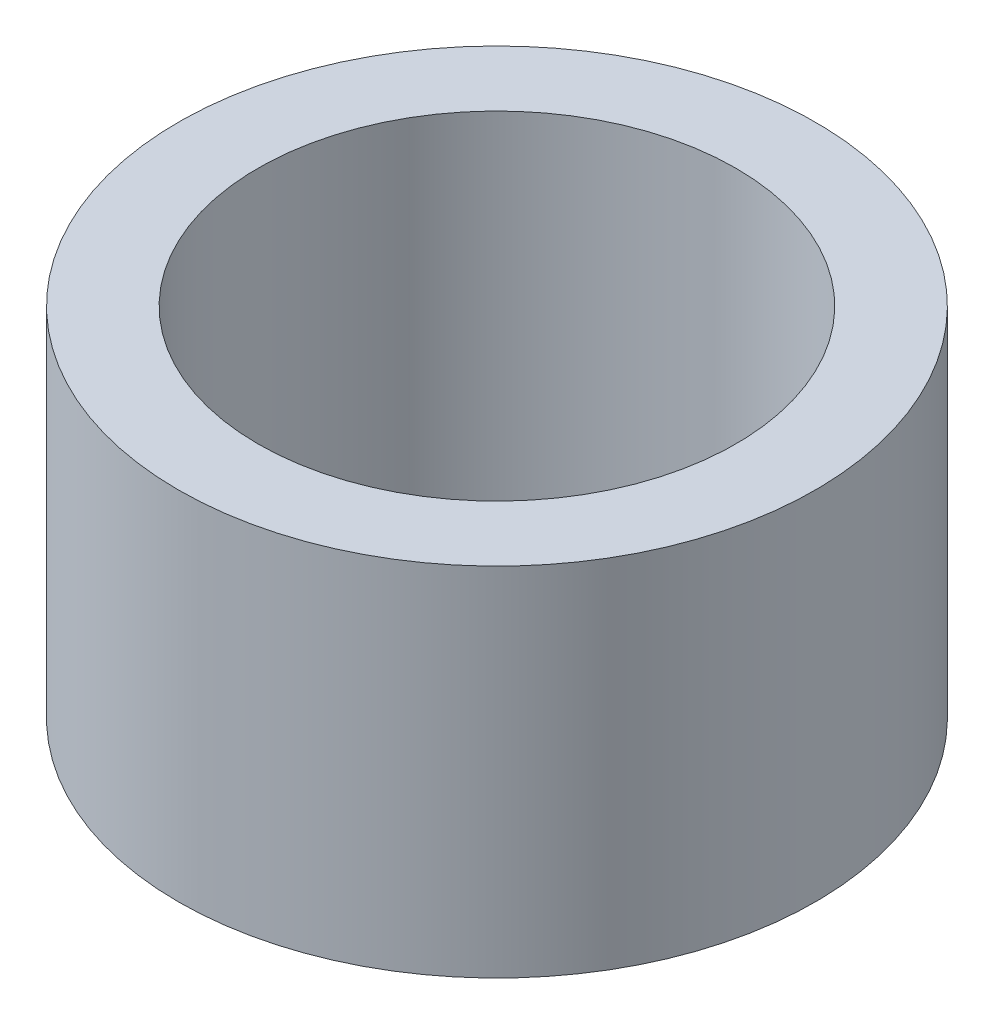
ISO-10303-21;
HEADER;
FILE_DESCRIPTION(('STEP AP214'),'2;1');
FILE_NAME('part.step','',(''),(''),'','','');
FILE_SCHEMA(('AUTOMOTIVE_DESIGN { 1 0 10303 214 1 1 1 1 }'));
ENDSEC;
DATA;
#1=APPLICATION_CONTEXT('core data for automotive mechanical design processes');
#2=APPLICATION_PROTOCOL_DEFINITION('international standard','automotive_design',2000,#1);
#3=PRODUCT_CONTEXT('',#1,'mechanical');
#4=PRODUCT('Part','Part','',(#3));
#5=PRODUCT_RELATED_PRODUCT_CATEGORY('part','',(#4));
#6=PRODUCT_DEFINITION_FORMATION('','',#4);
#7=PRODUCT_DEFINITION_CONTEXT('part definition',#1,'design');
#8=PRODUCT_DEFINITION('design','',#6,#7);
#9=PRODUCT_DEFINITION_SHAPE('','',#8);
#10=(LENGTH_UNIT() NAMED_UNIT(*) SI_UNIT(.MILLI.,.METRE.));
#11=(NAMED_UNIT(*) PLANE_ANGLE_UNIT() SI_UNIT($,.RADIAN.));
#12=(NAMED_UNIT(*) SI_UNIT($,.STERADIAN.) SOLID_ANGLE_UNIT());
#13=UNCERTAINTY_MEASURE_WITH_UNIT(LENGTH_MEASURE(1.E-05),#10,'distance_accuracy_value','');
#14=(GEOMETRIC_REPRESENTATION_CONTEXT(3) GLOBAL_UNCERTAINTY_ASSIGNED_CONTEXT((#13)) GLOBAL_UNIT_ASSIGNED_CONTEXT((#10,
#11,#12)) REPRESENTATION_CONTEXT('',''));
#15=CARTESIAN_POINT('',(0.,0.,0.));
#16=DIRECTION('',(0.,0.,1.));
#17=DIRECTION('',(1.,0.,0.));
#18=AXIS2_PLACEMENT_3D('',#15,#16,#17);
#19=CARTESIAN_POINT('',(0.,7.112,0.));
#20=DIRECTION('',(0.,1.,0.));
#21=DIRECTION('',(0.,0.,1.));
#22=AXIS2_PLACEMENT_3D('',#19,#20,#21);
#23=PLANE('',#22);
#24=CARTESIAN_POINT('',(0.,7.112,0.));
#25=DIRECTION('',(0.,1.,0.));
#26=DIRECTION('',(0.,0.,1.));
#27=AXIS2_PLACEMENT_3D('',#24,#25,#26);
#28=CIRCLE('',#27,6.35);
#29=CARTESIAN_POINT('',(0.,7.112,6.35));
#30=VERTEX_POINT('',#29);
#31=EDGE_CURVE('E10',#30,#30,#28,.T.);
#32=ORIENTED_EDGE('',*,*,#31,.T.);
#33=EDGE_LOOP('',(#32));
#34=FACE_BOUND('',#33,.T.);
#35=CARTESIAN_POINT('',(0.,7.112,0.));
#36=DIRECTION('',(0.,1.,0.));
#37=DIRECTION('',(0.,0.,1.));
#38=AXIS2_PLACEMENT_3D('',#35,#36,#37);
#39=CIRCLE('',#38,4.7625);
#40=CARTESIAN_POINT('',(0.,7.112,4.7625));
#41=VERTEX_POINT('',#40);
#42=EDGE_CURVE('E45',#41,#41,#39,.T.);
#43=ORIENTED_EDGE('',*,*,#42,.F.);
#44=EDGE_LOOP('',(#43));
#45=FACE_BOUND('',#44,.T.);
#46=ADVANCED_FACE('F34',(#34,#45),#23,.T.);
#47=CARTESIAN_POINT('',(0.,0.,0.));
#48=DIRECTION('',(0.,1.,0.));
#49=DIRECTION('',(0.,0.,1.));
#50=AXIS2_PLACEMENT_3D('',#47,#48,#49);
#51=PLANE('',#50);
#52=CARTESIAN_POINT('',(0.,0.,0.));
#53=DIRECTION('',(0.,1.,0.));
#54=DIRECTION('',(0.,0.,1.));
#55=AXIS2_PLACEMENT_3D('',#52,#53,#54);
#56=CIRCLE('',#55,6.35);
#57=CARTESIAN_POINT('',(0.,0.,6.35));
#58=VERTEX_POINT('',#57);
#59=EDGE_CURVE('E41',#58,#58,#56,.T.);
#60=ORIENTED_EDGE('',*,*,#59,.F.);
#61=EDGE_LOOP('',(#60));
#62=FACE_BOUND('',#61,.T.);
#63=CARTESIAN_POINT('',(0.,0.,0.));
#64=DIRECTION('',(0.,1.,0.));
#65=DIRECTION('',(0.,0.,1.));
#66=AXIS2_PLACEMENT_3D('',#63,#64,#65);
#67=CIRCLE('',#66,4.7625);
#68=CARTESIAN_POINT('',(0.,0.,4.7625));
#69=VERTEX_POINT('',#68);
#70=EDGE_CURVE('E49',#69,#69,#67,.T.);
#71=ORIENTED_EDGE('',*,*,#70,.T.);
#72=EDGE_LOOP('',(#71));
#73=FACE_BOUND('',#72,.T.);
#74=ADVANCED_FACE('F55',(#62,#73),#51,.F.);
#75=CARTESIAN_POINT('',(0.,7.112,0.));
#76=DIRECTION('',(0.,-1.,0.));
#77=DIRECTION('',(0.,0.,-1.));
#78=AXIS2_PLACEMENT_3D('',#75,#76,#77);
#79=CYLINDRICAL_SURFACE('',#78,6.35);
#80=ORIENTED_EDGE('',*,*,#31,.F.);
#81=EDGE_LOOP('',(#80));
#82=FACE_BOUND('',#81,.T.);
#83=ORIENTED_EDGE('',*,*,#59,.T.);
#84=EDGE_LOOP('',(#83));
#85=FACE_BOUND('',#84,.T.);
#86=ADVANCED_FACE('F36',(#82,#85),#79,.T.);
#87=CARTESIAN_POINT('',(0.,7.112,0.));
#88=DIRECTION('',(0.,-1.,0.));
#89=DIRECTION('',(0.,0.,-1.));
#90=AXIS2_PLACEMENT_3D('',#87,#88,#89);
#91=CYLINDRICAL_SURFACE('',#90,4.7625);
#92=ORIENTED_EDGE('',*,*,#42,.T.);
#93=EDGE_LOOP('',(#92));
#94=FACE_BOUND('',#93,.T.);
#95=ORIENTED_EDGE('',*,*,#70,.F.);
#96=EDGE_LOOP('',(#95));
#97=FACE_BOUND('',#96,.T.);
#98=ADVANCED_FACE('F57',(#94,#97),#91,.F.);
#99=CLOSED_SHELL('',(#46,#74,#86,#98));
#100=MANIFOLD_SOLID_BREP('B2',#99);
#101=ADVANCED_BREP_SHAPE_REPRESENTATION('',(#18,#100),#14);
#102=SHAPE_DEFINITION_REPRESENTATION(#9,#101);
ENDSEC;
END-ISO-10303-21;
